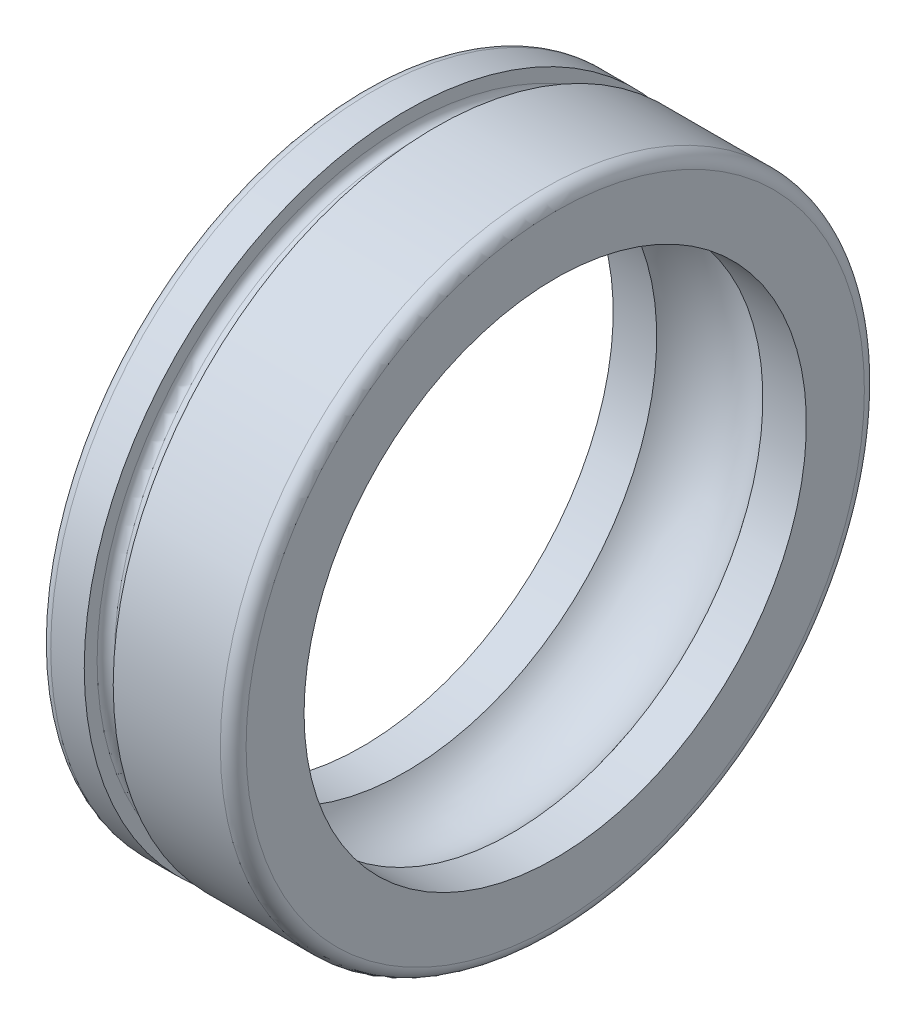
ISO-10303-21;
HEADER;
FILE_DESCRIPTION(('STEP AP214'),'2;1');
FILE_NAME('part.step','',(''),(''),'','','');
FILE_SCHEMA(('AUTOMOTIVE_DESIGN { 1 0 10303 214 1 1 1 1 }'));
ENDSEC;
DATA;
#1=APPLICATION_CONTEXT('core data for automotive mechanical design processes');
#2=APPLICATION_PROTOCOL_DEFINITION('international standard','automotive_design',2000,#1);
#3=PRODUCT_CONTEXT('',#1,'mechanical');
#4=PRODUCT('Part','Part','',(#3));
#5=PRODUCT_RELATED_PRODUCT_CATEGORY('part','',(#4));
#6=PRODUCT_DEFINITION_FORMATION('','',#4);
#7=PRODUCT_DEFINITION_CONTEXT('part definition',#1,'design');
#8=PRODUCT_DEFINITION('design','',#6,#7);
#9=PRODUCT_DEFINITION_SHAPE('','',#8);
#10=(LENGTH_UNIT() NAMED_UNIT(*) SI_UNIT(.MILLI.,.METRE.));
#11=(NAMED_UNIT(*) PLANE_ANGLE_UNIT() SI_UNIT($,.RADIAN.));
#12=(NAMED_UNIT(*) SI_UNIT($,.STERADIAN.) SOLID_ANGLE_UNIT());
#13=UNCERTAINTY_MEASURE_WITH_UNIT(LENGTH_MEASURE(1.E-05),#10,'distance_accuracy_value','');
#14=(GEOMETRIC_REPRESENTATION_CONTEXT(3) GLOBAL_UNCERTAINTY_ASSIGNED_CONTEXT((#13)) GLOBAL_UNIT_ASSIGNED_CONTEXT((#10,
#11,#12)) REPRESENTATION_CONTEXT('',''));
#15=CARTESIAN_POINT('',(0.,0.,0.));
#16=DIRECTION('',(0.,0.,1.));
#17=DIRECTION('',(1.,0.,0.));
#18=AXIS2_PLACEMENT_3D('',#15,#16,#17);
#19=CARTESIAN_POINT('',(0.,14.5,0.));
#20=DIRECTION('',(1.,0.,0.));
#21=DIRECTION('',(0.,0.,-1.));
#22=AXIS2_PLACEMENT_3D('',#19,#20,#21);
#23=PLANE('',#22);
#24=CARTESIAN_POINT('',(0.,0.,0.));
#25=DIRECTION('',(-1.,0.,0.));
#26=DIRECTION('',(0.,0.,1.));
#27=AXIS2_PLACEMENT_3D('',#24,#25,#26);
#28=CIRCLE('',#27,11.7);
#29=CARTESIAN_POINT('',(0.,0.,11.7));
#30=VERTEX_POINT('',#29);
#31=EDGE_CURVE('E10',#30,#30,#28,.T.);
#32=ORIENTED_EDGE('',*,*,#31,.F.);
#33=EDGE_LOOP('',(#32));
#34=FACE_BOUND('',#33,.T.);
#35=CARTESIAN_POINT('',(0.,0.,0.));
#36=DIRECTION('',(-1.,0.,0.));
#37=DIRECTION('',(0.,0.,1.));
#38=AXIS2_PLACEMENT_3D('',#35,#36,#37);
#39=CIRCLE('',#38,14.5);
#40=CARTESIAN_POINT('',(0.,0.,14.5));
#41=VERTEX_POINT('',#40);
#42=EDGE_CURVE('E80',#41,#41,#39,.T.);
#43=ORIENTED_EDGE('',*,*,#42,.T.);
#44=EDGE_LOOP('',(#43));
#45=FACE_BOUND('',#44,.T.);
#46=ADVANCED_FACE('F14',(#34,#45),#23,.F.);
#47=CARTESIAN_POINT('',(0.5,0.,0.));
#48=DIRECTION('',(-1.,0.,0.));
#49=DIRECTION('',(0.,0.,1.));
#50=AXIS2_PLACEMENT_3D('',#47,#48,#49);
#51=CYLINDRICAL_SURFACE('',#50,11.7);
#52=CARTESIAN_POINT('',(2.02815858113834,0.,0.));
#53=DIRECTION('',(-1.,0.,0.));
#54=DIRECTION('',(0.,0.,1.));
#55=AXIS2_PLACEMENT_3D('',#52,#53,#54);
#56=CIRCLE('',#55,11.7);
#57=CARTESIAN_POINT('',(2.02815858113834,0.,11.7));
#58=VERTEX_POINT('',#57);
#59=EDGE_CURVE('E21',#58,#58,#56,.T.);
#60=ORIENTED_EDGE('',*,*,#59,.F.);
#61=EDGE_LOOP('',(#60));
#62=FACE_BOUND('',#61,.T.);
#63=ORIENTED_EDGE('',*,*,#31,.T.);
#64=EDGE_LOOP('',(#63));
#65=FACE_BOUND('',#64,.T.);
#66=ADVANCED_FACE('F117',(#62,#65),#51,.F.);
#67=CARTESIAN_POINT('',(4.5,0.,0.));
#68=DIRECTION('',(-1.,0.,0.));
#69=DIRECTION('',(0.,0.,1.));
#70=AXIS2_PLACEMENT_3D('',#67,#68,#69);
#71=TOROIDAL_SURFACE('',#70,10.,3.);
#72=ORIENTED_EDGE('',*,*,#59,.T.);
#73=EDGE_LOOP('',(#72));
#74=FACE_BOUND('',#73,.T.);
#75=CARTESIAN_POINT('',(6.97184141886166,0.,0.));
#76=DIRECTION('',(-1.,0.,0.));
#77=DIRECTION('',(0.,0.,1.));
#78=AXIS2_PLACEMENT_3D('',#75,#76,#77);
#79=CIRCLE('',#78,11.7);
#80=CARTESIAN_POINT('',(6.97184141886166,0.,11.7));
#81=VERTEX_POINT('',#80);
#82=EDGE_CURVE('E30',#81,#81,#79,.T.);
#83=ORIENTED_EDGE('',*,*,#82,.F.);
#84=EDGE_LOOP('',(#83));
#85=FACE_BOUND('',#84,.T.);
#86=ADVANCED_FACE('F122',(#74,#85),#71,.F.);
#87=CARTESIAN_POINT('',(0.5,0.,0.));
#88=DIRECTION('',(-1.,0.,0.));
#89=DIRECTION('',(0.,0.,1.));
#90=AXIS2_PLACEMENT_3D('',#87,#88,#89);
#91=CYLINDRICAL_SURFACE('',#90,11.7);
#92=CARTESIAN_POINT('',(9.,0.,0.));
#93=DIRECTION('',(-1.,0.,0.));
#94=DIRECTION('',(0.,0.,1.));
#95=AXIS2_PLACEMENT_3D('',#92,#93,#94);
#96=CIRCLE('',#95,11.7);
#97=CARTESIAN_POINT('',(9.,0.,11.7));
#98=VERTEX_POINT('',#97);
#99=EDGE_CURVE('E38',#98,#98,#96,.T.);
#100=ORIENTED_EDGE('',*,*,#99,.F.);
#101=EDGE_LOOP('',(#100));
#102=FACE_BOUND('',#101,.T.);
#103=ORIENTED_EDGE('',*,*,#82,.T.);
#104=EDGE_LOOP('',(#103));
#105=FACE_BOUND('',#104,.T.);
#106=ADVANCED_FACE('F127',(#102,#105),#91,.F.);
#107=CARTESIAN_POINT('',(9.,11.7,0.));
#108=DIRECTION('',(-1.,0.,0.));
#109=DIRECTION('',(0.,0.,1.));
#110=AXIS2_PLACEMENT_3D('',#107,#108,#109);
#111=PLANE('',#110);
#112=CARTESIAN_POINT('',(9.,0.,0.));
#113=DIRECTION('',(-1.,0.,0.));
#114=DIRECTION('',(0.,0.,1.));
#115=AXIS2_PLACEMENT_3D('',#112,#113,#114);
#116=CIRCLE('',#115,14.4);
#117=CARTESIAN_POINT('',(9.,0.,14.4));
#118=VERTEX_POINT('',#117);
#119=EDGE_CURVE('E44',#118,#118,#116,.T.);
#120=ORIENTED_EDGE('',*,*,#119,.F.);
#121=EDGE_LOOP('',(#120));
#122=FACE_BOUND('',#121,.T.);
#123=ORIENTED_EDGE('',*,*,#99,.T.);
#124=EDGE_LOOP('',(#123));
#125=FACE_BOUND('',#124,.T.);
#126=ADVANCED_FACE('F132',(#122,#125),#111,.F.);
#127=CARTESIAN_POINT('',(8.4,0.,0.));
#128=DIRECTION('',(-1.,0.,0.));
#129=DIRECTION('',(0.,0.,1.));
#130=AXIS2_PLACEMENT_3D('',#127,#128,#129);
#131=TOROIDAL_SURFACE('',#130,14.4,0.6);
#132=CARTESIAN_POINT('',(8.4,0.,0.));
#133=DIRECTION('',(-1.,0.,0.));
#134=DIRECTION('',(0.,0.,1.));
#135=AXIS2_PLACEMENT_3D('',#132,#133,#134);
#136=CIRCLE('',#135,15.);
#137=CARTESIAN_POINT('',(8.4,0.,15.));
#138=VERTEX_POINT('',#137);
#139=EDGE_CURVE('E48',#138,#138,#136,.T.);
#140=ORIENTED_EDGE('',*,*,#139,.F.);
#141=EDGE_LOOP('',(#140));
#142=FACE_BOUND('',#141,.T.);
#143=ORIENTED_EDGE('',*,*,#119,.T.);
#144=EDGE_LOOP('',(#143));
#145=FACE_BOUND('',#144,.T.);
#146=ADVANCED_FACE('F136',(#142,#145),#131,.T.);
#147=CARTESIAN_POINT('',(0.5,0.,0.));
#148=DIRECTION('',(-1.,0.,0.));
#149=DIRECTION('',(0.,0.,1.));
#150=AXIS2_PLACEMENT_3D('',#147,#148,#149);
#151=CYLINDRICAL_SURFACE('',#150,15.);
#152=CARTESIAN_POINT('',(3.41,0.,0.));
#153=DIRECTION('',(-1.,0.,0.));
#154=DIRECTION('',(0.,0.,1.));
#155=AXIS2_PLACEMENT_3D('',#152,#153,#154);
#156=CIRCLE('',#155,15.);
#157=CARTESIAN_POINT('',(3.41,0.,15.));
#158=VERTEX_POINT('',#157);
#159=EDGE_CURVE('E52',#158,#158,#156,.T.);
#160=ORIENTED_EDGE('',*,*,#159,.F.);
#161=EDGE_LOOP('',(#160));
#162=FACE_BOUND('',#161,.T.);
#163=ORIENTED_EDGE('',*,*,#139,.T.);
#164=EDGE_LOOP('',(#163));
#165=FACE_BOUND('',#164,.T.);
#166=ADVANCED_FACE('F140',(#162,#165),#151,.T.);
#167=CARTESIAN_POINT('',(3.41,15.,0.));
#168=DIRECTION('',(1.,0.,0.));
#169=DIRECTION('',(0.,0.,-1.));
#170=AXIS2_PLACEMENT_3D('',#167,#168,#169);
#171=PLANE('',#170);
#172=CARTESIAN_POINT('',(3.41,0.,0.));
#173=DIRECTION('',(-1.,0.,0.));
#174=DIRECTION('',(0.,0.,1.));
#175=AXIS2_PLACEMENT_3D('',#172,#173,#174);
#176=CIRCLE('',#175,14.4);
#177=CARTESIAN_POINT('',(3.41,0.,14.4));
#178=VERTEX_POINT('',#177);
#179=EDGE_CURVE('E56',#178,#178,#176,.T.);
#180=ORIENTED_EDGE('',*,*,#179,.F.);
#181=EDGE_LOOP('',(#180));
#182=FACE_BOUND('',#181,.T.);
#183=ORIENTED_EDGE('',*,*,#159,.T.);
#184=EDGE_LOOP('',(#183));
#185=FACE_BOUND('',#184,.T.);
#186=ADVANCED_FACE('F144',(#182,#185),#171,.F.);
#187=CARTESIAN_POINT('',(3.01,0.,0.));
#188=DIRECTION('',(-1.,0.,0.));
#189=DIRECTION('',(0.,0.,1.));
#190=AXIS2_PLACEMENT_3D('',#187,#188,#189);
#191=TOROIDAL_SURFACE('',#190,14.4,0.4);
#192=ORIENTED_EDGE('',*,*,#179,.T.);
#193=EDGE_LOOP('',(#192));
#194=FACE_BOUND('',#193,.T.);
#195=CARTESIAN_POINT('',(3.01,0.,0.));
#196=DIRECTION('',(-1.,0.,0.));
#197=DIRECTION('',(0.,0.,1.));
#198=AXIS2_PLACEMENT_3D('',#195,#196,#197);
#199=CIRCLE('',#198,14.);
#200=CARTESIAN_POINT('',(3.01,0.,14.));
#201=VERTEX_POINT('',#200);
#202=EDGE_CURVE('E60',#201,#201,#199,.T.);
#203=ORIENTED_EDGE('',*,*,#202,.F.);
#204=EDGE_LOOP('',(#203));
#205=FACE_BOUND('',#204,.T.);
#206=ADVANCED_FACE('F113',(#194,#205),#191,.F.);
#207=CARTESIAN_POINT('',(0.5,0.,0.));
#208=DIRECTION('',(-1.,0.,0.));
#209=DIRECTION('',(0.,0.,1.));
#210=AXIS2_PLACEMENT_3D('',#207,#208,#209);
#211=CYLINDRICAL_SURFACE('',#210,14.);
#212=CARTESIAN_POINT('',(2.46,0.,0.));
#213=DIRECTION('',(-1.,0.,0.));
#214=DIRECTION('',(0.,0.,1.));
#215=AXIS2_PLACEMENT_3D('',#212,#213,#214);
#216=CIRCLE('',#215,14.);
#217=CARTESIAN_POINT('',(2.46,0.,14.));
#218=VERTEX_POINT('',#217);
#219=EDGE_CURVE('E64',#218,#218,#216,.T.);
#220=ORIENTED_EDGE('',*,*,#219,.F.);
#221=EDGE_LOOP('',(#220));
#222=FACE_BOUND('',#221,.T.);
#223=ORIENTED_EDGE('',*,*,#202,.T.);
#224=EDGE_LOOP('',(#223));
#225=FACE_BOUND('',#224,.T.);
#226=ADVANCED_FACE('F106',(#222,#225),#211,.T.);
#227=CARTESIAN_POINT('',(2.46,0.,0.));
#228=DIRECTION('',(-1.,0.,0.));
#229=DIRECTION('',(0.,0.,1.));
#230=AXIS2_PLACEMENT_3D('',#227,#228,#229);
#231=TOROIDAL_SURFACE('',#230,14.4,0.4);
#232=ORIENTED_EDGE('',*,*,#219,.T.);
#233=EDGE_LOOP('',(#232));
#234=FACE_BOUND('',#233,.T.);
#235=CARTESIAN_POINT('',(2.06,0.,0.));
#236=DIRECTION('',(-1.,0.,0.));
#237=DIRECTION('',(0.,0.,1.));
#238=AXIS2_PLACEMENT_3D('',#235,#236,#237);
#239=CIRCLE('',#238,14.4);
#240=CARTESIAN_POINT('',(2.06,0.,14.4));
#241=VERTEX_POINT('',#240);
#242=EDGE_CURVE('E68',#241,#241,#239,.T.);
#243=ORIENTED_EDGE('',*,*,#242,.F.);
#244=EDGE_LOOP('',(#243));
#245=FACE_BOUND('',#244,.T.);
#246=ADVANCED_FACE('F101',(#234,#245),#231,.F.);
#247=CARTESIAN_POINT('',(2.06,14.4,0.));
#248=DIRECTION('',(-1.,0.,0.));
#249=DIRECTION('',(0.,0.,1.));
#250=AXIS2_PLACEMENT_3D('',#247,#248,#249);
#251=PLANE('',#250);
#252=CARTESIAN_POINT('',(2.06,0.,0.));
#253=DIRECTION('',(-1.,0.,0.));
#254=DIRECTION('',(0.,0.,1.));
#255=AXIS2_PLACEMENT_3D('',#252,#253,#254);
#256=CIRCLE('',#255,15.);
#257=CARTESIAN_POINT('',(2.06,0.,15.));
#258=VERTEX_POINT('',#257);
#259=EDGE_CURVE('E72',#258,#258,#256,.T.);
#260=ORIENTED_EDGE('',*,*,#259,.F.);
#261=EDGE_LOOP('',(#260));
#262=FACE_BOUND('',#261,.T.);
#263=ORIENTED_EDGE('',*,*,#242,.T.);
#264=EDGE_LOOP('',(#263));
#265=FACE_BOUND('',#264,.T.);
#266=ADVANCED_FACE('F95',(#262,#265),#251,.F.);
#267=CARTESIAN_POINT('',(0.5,0.,0.));
#268=DIRECTION('',(-1.,0.,0.));
#269=DIRECTION('',(0.,0.,1.));
#270=AXIS2_PLACEMENT_3D('',#267,#268,#269);
#271=CYLINDRICAL_SURFACE('',#270,15.);
#272=CARTESIAN_POINT('',(0.5,0.,0.));
#273=DIRECTION('',(-1.,0.,0.));
#274=DIRECTION('',(0.,0.,1.));
#275=AXIS2_PLACEMENT_3D('',#272,#273,#274);
#276=CIRCLE('',#275,15.);
#277=CARTESIAN_POINT('',(0.5,0.,15.));
#278=VERTEX_POINT('',#277);
#279=EDGE_CURVE('E76',#278,#278,#276,.T.);
#280=ORIENTED_EDGE('',*,*,#279,.F.);
#281=EDGE_LOOP('',(#280));
#282=FACE_BOUND('',#281,.T.);
#283=ORIENTED_EDGE('',*,*,#259,.T.);
#284=EDGE_LOOP('',(#283));
#285=FACE_BOUND('',#284,.T.);
#286=ADVANCED_FACE('F89',(#282,#285),#271,.T.);
#287=CARTESIAN_POINT('',(0.5,0.,0.));
#288=DIRECTION('',(-1.,0.,0.));
#289=DIRECTION('',(0.,0.,1.));
#290=AXIS2_PLACEMENT_3D('',#287,#288,#289);
#291=TOROIDAL_SURFACE('',#290,14.5,0.5);
#292=ORIENTED_EDGE('',*,*,#42,.F.);
#293=EDGE_LOOP('',(#292));
#294=FACE_BOUND('',#293,.T.);
#295=ORIENTED_EDGE('',*,*,#279,.T.);
#296=EDGE_LOOP('',(#295));
#297=FACE_BOUND('',#296,.T.);
#298=ADVANCED_FACE('F86',(#294,#297),#291,.T.);
#299=CLOSED_SHELL('',(#46,#66,#86,#106,#126,#146,#166,#186,#206,#226,#246,#266,#286,#298));
#300=MANIFOLD_SOLID_BREP('B1',#299);
#301=ADVANCED_BREP_SHAPE_REPRESENTATION('',(#18,#300),#14);
#302=SHAPE_DEFINITION_REPRESENTATION(#9,#301);
ENDSEC;
END-ISO-10303-21;
